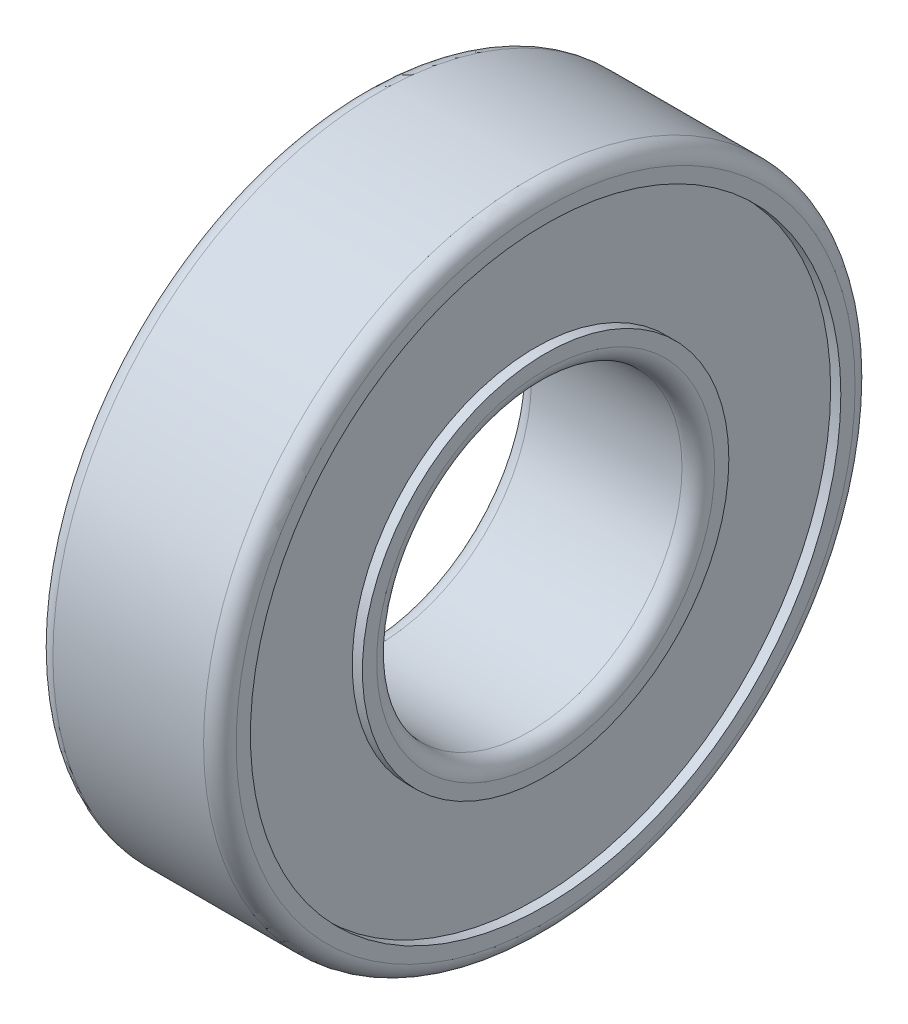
from build123d import *

# Parameters (mm, degrees)
FILLET_1_R = 0.8


with BuildPart() as part:
    # Sketch 1 → Revolve 1 (revolve)
    with BuildSketch(Plane.XY, mode=Mode.PRIVATE) as revolve_1_sk:
        Polygon((4.5, 7.5), (-4.5, 7.5), (-4.5, 9), (-4, 9), (-4, 14.5), (-4.5, 14.5), (-4.5, 16), (4.5, 16), (4.5, 14.5), (4, 14.5), (4, 9), (4.5, 9), align=None)
    revolve(revolve_1_sk.sketch.rotate(Axis((0, 0, 0), (-1, 0, 0)), 90), axis=Axis((0, 0, 0), (-1, 0, 0)))

    # Fillet 1
    fillet_1_edges = [part.edges().sort_by_distance(p)[0] for p in [
        (-4.5, 0, 16),
        (4.5, 0, 16),
        (4.5, 0, 7.5),
        (-4.5, 0, 7.5),
    ]]
    fillet(fillet_1_edges, radius=FILLET_1_R)


solid = part.part
